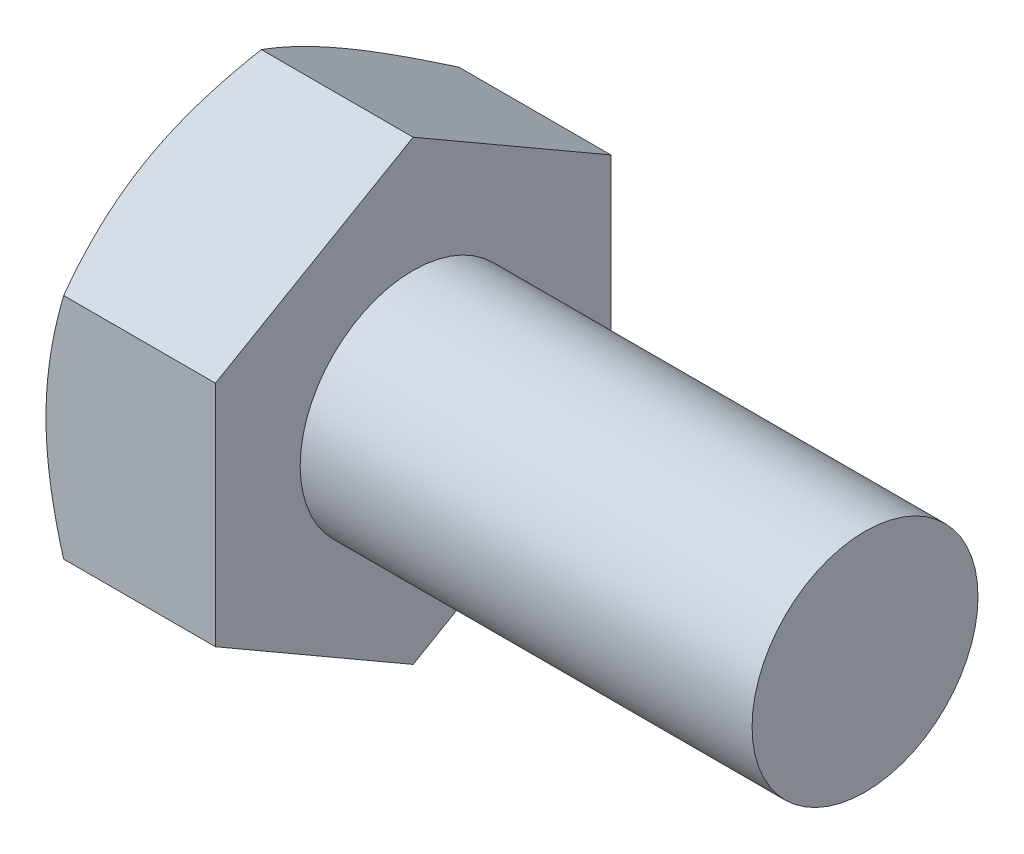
ISO-10303-21;
HEADER;
FILE_DESCRIPTION(('STEP AP214'),'2;1');
FILE_NAME('part.step','',(''),(''),'','','');
FILE_SCHEMA(('AUTOMOTIVE_DESIGN { 1 0 10303 214 1 1 1 1 }'));
ENDSEC;
DATA;
#1=APPLICATION_CONTEXT('core data for automotive mechanical design processes');
#2=APPLICATION_PROTOCOL_DEFINITION('international standard','automotive_design',2000,#1);
#3=PRODUCT_CONTEXT('',#1,'mechanical');
#4=PRODUCT('Part','Part','',(#3));
#5=PRODUCT_RELATED_PRODUCT_CATEGORY('part','',(#4));
#6=PRODUCT_DEFINITION_FORMATION('','',#4);
#7=PRODUCT_DEFINITION_CONTEXT('part definition',#1,'design');
#8=PRODUCT_DEFINITION('design','',#6,#7);
#9=PRODUCT_DEFINITION_SHAPE('','',#8);
#10=(LENGTH_UNIT() NAMED_UNIT(*) SI_UNIT(.MILLI.,.METRE.));
#11=(NAMED_UNIT(*) PLANE_ANGLE_UNIT() SI_UNIT($,.RADIAN.));
#12=(NAMED_UNIT(*) SI_UNIT($,.STERADIAN.) SOLID_ANGLE_UNIT());
#13=UNCERTAINTY_MEASURE_WITH_UNIT(LENGTH_MEASURE(1.E-05),#10,'distance_accuracy_value','');
#14=(GEOMETRIC_REPRESENTATION_CONTEXT(3) GLOBAL_UNCERTAINTY_ASSIGNED_CONTEXT((#13)) GLOBAL_UNIT_ASSIGNED_CONTEXT((#10,
#11,#12)) REPRESENTATION_CONTEXT('',''));
#15=CARTESIAN_POINT('',(0.,0.,0.));
#16=DIRECTION('',(0.,0.,1.));
#17=DIRECTION('',(1.,0.,0.));
#18=AXIS2_PLACEMENT_3D('',#15,#16,#17);
#19=CARTESIAN_POINT('',(3.,2.,0.));
#20=DIRECTION('',(-1.,0.,0.));
#21=DIRECTION('',(0.,0.,1.));
#22=AXIS2_PLACEMENT_3D('',#19,#20,#21);
#23=PLANE('',#22);
#24=CARTESIAN_POINT('',(3.,0.,0.));
#25=DIRECTION('',(-1.,0.,0.));
#26=DIRECTION('',(0.,0.,1.));
#27=AXIS2_PLACEMENT_3D('',#24,#25,#26);
#28=CIRCLE('',#27,2.);
#29=CARTESIAN_POINT('',(3.,0.,2.));
#30=VERTEX_POINT('',#29);
#31=EDGE_CURVE('E191',#30,#30,#28,.T.);
#32=ORIENTED_EDGE('',*,*,#31,.T.);
#33=EDGE_LOOP('',(#32));
#34=FACE_BOUND('',#33,.T.);
#35=DIRECTION('',(0.,1.,0.));
#36=VECTOR('',#35,1.);
#37=CARTESIAN_POINT('',(3.,-2.02072595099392,3.5));
#38=LINE('',#37,#36);
#39=CARTESIAN_POINT('',(3.,-2.02072595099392,3.5));
#40=VERTEX_POINT('',#39);
#41=CARTESIAN_POINT('',(3.,2.02072595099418,3.5));
#42=VERTEX_POINT('',#41);
#43=EDGE_CURVE('E55',#40,#42,#38,.T.);
#44=ORIENTED_EDGE('',*,*,#43,.F.);
#45=DIRECTION('',(0.,0.50000000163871,0.866025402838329));
#46=VECTOR('',#45,1.);
#47=CARTESIAN_POINT('',(3.,-4.04145190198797,0.));
#48=LINE('',#47,#46);
#49=CARTESIAN_POINT('',(3.,-4.04145190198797,0.));
#50=VERTEX_POINT('',#49);
#51=EDGE_CURVE('E128',#50,#40,#48,.T.);
#52=ORIENTED_EDGE('',*,*,#51,.F.);
#53=DIRECTION('',(0.,-0.50000000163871,0.866025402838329));
#54=VECTOR('',#53,1.);
#55=CARTESIAN_POINT('',(3.,-2.02072595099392,-3.5));
#56=LINE('',#55,#54);
#57=CARTESIAN_POINT('',(3.,-2.02072595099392,-3.5));
#58=VERTEX_POINT('',#57);
#59=EDGE_CURVE('E126',#58,#50,#56,.T.);
#60=ORIENTED_EDGE('',*,*,#59,.F.);
#61=DIRECTION('',(0.,-1.,0.));
#62=VECTOR('',#61,1.);
#63=CARTESIAN_POINT('',(3.,2.02072595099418,-3.5));
#64=LINE('',#63,#62);
#65=CARTESIAN_POINT('',(3.,2.02072595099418,-3.5));
#66=VERTEX_POINT('',#65);
#67=EDGE_CURVE('E109',#66,#58,#64,.T.);
#68=ORIENTED_EDGE('',*,*,#67,.F.);
#69=DIRECTION('',(0.,-0.50000000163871,-0.866025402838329));
#70=VECTOR('',#69,1.);
#71=CARTESIAN_POINT('',(3.,4.04145190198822,0.));
#72=LINE('',#71,#70);
#73=CARTESIAN_POINT('',(3.,4.04145190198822,0.));
#74=VERTEX_POINT('',#73);
#75=EDGE_CURVE('E118',#74,#66,#72,.T.);
#76=ORIENTED_EDGE('',*,*,#75,.F.);
#77=DIRECTION('',(0.,0.50000000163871,-0.866025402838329));
#78=VECTOR('',#77,1.);
#79=CARTESIAN_POINT('',(3.,2.02072595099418,3.5));
#80=LINE('',#79,#78);
#81=EDGE_CURVE('E122',#42,#74,#80,.T.);
#82=ORIENTED_EDGE('',*,*,#81,.F.);
#83=EDGE_LOOP('',(#44,#52,#60,#68,#76,#82));
#84=FACE_BOUND('',#83,.T.);
#85=ADVANCED_FACE('F32',(#34,#84),#23,.F.);
#86=CARTESIAN_POINT('',(-25.4,0.,0.));
#87=DIRECTION('',(-1.,0.,0.));
#88=DIRECTION('',(0.,0.,1.));
#89=AXIS2_PLACEMENT_3D('',#86,#87,#88);
#90=CYLINDRICAL_SURFACE('',#89,2.);
#91=CARTESIAN_POINT('',(11.,0.,0.));
#92=DIRECTION('',(-1.,0.,0.));
#93=DIRECTION('',(0.,0.,1.));
#94=AXIS2_PLACEMENT_3D('',#91,#92,#93);
#95=CIRCLE('',#94,2.);
#96=CARTESIAN_POINT('',(11.,0.,2.));
#97=VERTEX_POINT('',#96);
#98=EDGE_CURVE('E11',#97,#97,#95,.T.);
#99=ORIENTED_EDGE('',*,*,#98,.T.);
#100=EDGE_LOOP('',(#99));
#101=FACE_BOUND('',#100,.T.);
#102=ORIENTED_EDGE('',*,*,#31,.F.);
#103=EDGE_LOOP('',(#102));
#104=FACE_BOUND('',#103,.T.);
#105=ADVANCED_FACE('F34',(#101,#104),#90,.T.);
#106=CARTESIAN_POINT('',(11.,2.,0.));
#107=DIRECTION('',(1.,0.,0.));
#108=DIRECTION('',(0.,0.,-1.));
#109=AXIS2_PLACEMENT_3D('',#106,#107,#108);
#110=PLANE('',#109);
#111=ORIENTED_EDGE('',*,*,#98,.F.);
#112=EDGE_LOOP('',(#111));
#113=FACE_BOUND('',#112,.T.);
#114=ADVANCED_FACE('F174',(#113),#110,.T.);
#115=CARTESIAN_POINT('',(3.,-2.02072595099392,3.5));
#116=DIRECTION('',(0.,0.,1.));
#117=DIRECTION('',(0.,-1.,0.));
#118=AXIS2_PLACEMENT_3D('',#115,#116,#117);
#119=PLANE('',#118);
#120=DIRECTION('',(-1.,0.,0.));
#121=VECTOR('',#120,1.);
#122=CARTESIAN_POINT('',(3.,-2.02072595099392,3.5));
#123=LINE('',#122,#121);
#124=CARTESIAN_POINT('',(0.312607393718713,-2.02072595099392,3.5));
#125=VERTEX_POINT('',#124);
#126=EDGE_CURVE('E135',#40,#125,#123,.T.);
#127=ORIENTED_EDGE('',*,*,#126,.F.);
#128=ORIENTED_EDGE('',*,*,#43,.T.);
#129=DIRECTION('',(-1.,0.,0.));
#130=VECTOR('',#129,1.);
#131=CARTESIAN_POINT('',(3.,2.02072595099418,3.5));
#132=LINE('',#131,#130);
#133=CARTESIAN_POINT('',(0.312607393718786,2.02072595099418,3.5));
#134=VERTEX_POINT('',#133);
#135=EDGE_CURVE('E134',#42,#134,#132,.T.);
#136=ORIENTED_EDGE('',*,*,#135,.T.);
#137=CARTESIAN_POINT('',(1.67484806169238,-5.35927249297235,3.5));
#138=CARTESIAN_POINT('',(1.60058625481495,-5.20560262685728,3.5));
#139=CARTESIAN_POINT('',(1.52706266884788,-5.05156943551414,3.5));
#140=CARTESIAN_POINT('',(1.38191378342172,-4.7425799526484,3.5));
#141=CARTESIAN_POINT('',(1.31028881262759,-4.58762350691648,3.5));
#142=CARTESIAN_POINT('',(1.1689816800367,-4.27575400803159,3.5));
#143=CARTESIAN_POINT('',(1.09931298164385,-4.11883483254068,3.5));
#144=CARTESIAN_POINT('',(0.962968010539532,-3.80370674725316,3.5));
#145=CARTESIAN_POINT('',(0.896291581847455,-3.64549790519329,3.5));
#146=CARTESIAN_POINT('',(0.765935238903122,-3.32557477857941,3.5));
#147=CARTESIAN_POINT('',(0.702302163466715,-3.16384130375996,3.5));
#148=CARTESIAN_POINT('',(0.580019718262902,-2.83846669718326,3.5));
#149=CARTESIAN_POINT('',(0.521370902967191,-2.67482535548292,3.5));
#150=CARTESIAN_POINT('',(0.410632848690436,-2.34571076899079,3.5));
#151=CARTESIAN_POINT('',(0.358529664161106,-2.18024226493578,3.5));
#152=CARTESIAN_POINT('',(0.262575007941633,-1.84695290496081,3.5));
#153=CARTESIAN_POINT('',(0.218720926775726,-1.67913281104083,3.5));
#154=CARTESIAN_POINT('',(0.141393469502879,-1.34102565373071,3.5));
#155=CARTESIAN_POINT('',(0.107922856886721,-1.17073794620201,3.5));
#156=CARTESIAN_POINT('',(0.053615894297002,-0.82810943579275,3.5));
#157=CARTESIAN_POINT('',(0.0327795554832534,-0.655768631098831,3.5));
#158=CARTESIAN_POINT('',(0.00558442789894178,-0.311027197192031,3.5));
#159=CARTESIAN_POINT('',(-0.00086601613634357,-0.138633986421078,3.5));
#160=CARTESIAN_POINT('',(0.00105333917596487,0.206031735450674,3.5));
#161=CARTESIAN_POINT('',(0.0094192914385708,0.378304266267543,3.5));
#162=CARTESIAN_POINT('',(0.0357682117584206,0.672484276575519,3.5));
#163=CARTESIAN_POINT('',(0.0503198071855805,0.794716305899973,3.5));
#164=CARTESIAN_POINT('',(0.0859356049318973,1.03823616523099,3.5));
#165=CARTESIAN_POINT('',(0.107000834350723,1.15952384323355,3.5));
#166=CARTESIAN_POINT('',(0.178861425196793,1.52187147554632,3.5));
#167=CARTESIAN_POINT('',(0.238303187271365,1.76123299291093,3.5));
#168=CARTESIAN_POINT('',(0.340824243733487,2.11940111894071,3.5));
#169=CARTESIAN_POINT('',(0.377746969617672,2.24007467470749,3.5));
#170=CARTESIAN_POINT('',(0.45524596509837,2.4801622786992,3.5));
#171=CARTESIAN_POINT('',(0.495819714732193,2.59957713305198,3.5));
#172=CARTESIAN_POINT('',(0.579776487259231,2.83664797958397,3.5));
#173=CARTESIAN_POINT('',(0.623142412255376,2.9543100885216,3.5));
#174=CARTESIAN_POINT('',(0.712419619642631,3.1887214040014,3.5));
#175=CARTESIAN_POINT('',(0.758331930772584,3.30547021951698,3.5));
#176=CARTESIAN_POINT('',(0.805266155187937,3.42179689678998,3.5));
#177=B_SPLINE_CURVE_WITH_KNOTS('',3,(#137,#138,#139,#140,#141,#142,#143,#144,#145,#146,#147,
#148,#149,#150,#151,#152,#153,#154,#155,#156,#157,#158,#159,#160,#161,#162,#163,#164,#165,#166,
#167,#168,#169,#170,#171,#172,#173,#174,#175,#176),.UNSPECIFIED.,.F.,.F.,(4,2,2,2,2,2,2,2,2,2,2,
2,2,2,2,2,2,2,2,4),(0.,0.512025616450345,1.02413929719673,1.53918358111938,2.05420098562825,
2.57554135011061,3.09693963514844,3.617207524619,4.13731055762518,4.65755189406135,
5.17779369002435,5.69471134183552,6.2114947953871,6.58060002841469,6.9497634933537,
7.68863984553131,8.06719737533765,8.44549559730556,8.82166450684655,9.19798651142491),.UNSPECIFIED.);
#178=CARTESIAN_POINT('',(0.,0.,3.5));
#179=VERTEX_POINT('',#178);
#180=EDGE_CURVE('E176',#179,#134,#177,.T.);
#181=ORIENTED_EDGE('',*,*,#180,.F.);
#182=EDGE_CURVE('E183',#125,#179,#177,.T.);
#183=ORIENTED_EDGE('',*,*,#182,.F.);
#184=EDGE_LOOP('',(#127,#128,#136,#181,#183));
#185=FACE_BOUND('',#184,.T.);
#186=ADVANCED_FACE('F170',(#185),#119,.T.);
#187=CARTESIAN_POINT('',(3.,-4.04145190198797,0.));
#188=DIRECTION('',(0.,-0.866025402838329,0.50000000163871));
#189=DIRECTION('',(0.,-0.50000000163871,-0.866025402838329));
#190=AXIS2_PLACEMENT_3D('',#187,#188,#189);
#191=PLANE('',#190);
#192=DIRECTION('',(-1.,0.,0.));
#193=VECTOR('',#192,1.);
#194=CARTESIAN_POINT('',(3.,-4.04145190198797,0.));
#195=LINE('',#194,#193);
#196=CARTESIAN_POINT('',(0.312607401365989,-4.04145190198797,0.));
#197=VERTEX_POINT('',#196);
#198=EDGE_CURVE('E139',#50,#197,#195,.T.);
#199=ORIENTED_EDGE('',*,*,#198,.F.);
#200=ORIENTED_EDGE('',*,*,#51,.T.);
#201=ORIENTED_EDGE('',*,*,#126,.T.);
#202=CARTESIAN_POINT('',(0.312674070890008,-4.04156737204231,-0.000200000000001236));
#203=CARTESIAN_POINT('',(0.261385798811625,-3.95276675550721,0.153607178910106));
#204=CARTESIAN_POINT('',(0.214740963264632,-3.86319961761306,0.308742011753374));
#205=CARTESIAN_POINT('',(0.133321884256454,-3.6825143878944,0.621698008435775));
#206=CARTESIAN_POINT('',(0.098576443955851,-3.59139308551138,0.779524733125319));
#207=CARTESIAN_POINT('',(0.0444900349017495,-3.41027975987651,1.09322221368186));
#208=CARTESIAN_POINT('',(0.0247890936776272,-3.32031560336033,1.24904470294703));
#209=CARTESIAN_POINT('',(0.00127013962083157,-3.13996397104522,1.56142289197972));
#210=CARTESIAN_POINT('',(-0.00256734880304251,-3.04957715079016,1.71797745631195));
#211=CARTESIAN_POINT('',(0.00541530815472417,-2.88068385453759,2.01050922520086));
#212=CARTESIAN_POINT('',(0.0152754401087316,-2.80215209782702,2.14653021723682));
#213=CARTESIAN_POINT('',(0.0465264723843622,-2.64560021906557,2.41768602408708));
#214=CARTESIAN_POINT('',(0.0679280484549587,-2.56758063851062,2.55281990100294));
#215=CARTESIAN_POINT('',(0.121430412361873,-2.41070597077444,2.82453479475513));
#216=CARTESIAN_POINT('',(0.153757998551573,-2.33187073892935,2.96108142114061));
#217=CARTESIAN_POINT('',(0.227128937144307,-2.1753760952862,3.23213809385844));
#218=CARTESIAN_POINT('',(0.268155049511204,-2.09771467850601,3.3666516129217));
#219=CARTESIAN_POINT('',(0.312674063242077,-2.02061048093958,3.5002));
#220=B_SPLINE_CURVE_WITH_KNOTS('',3,(#202,#203,#204,#205,#206,#207,#208,#209,#210,#211,#212,
#213,#214,#215,#216,#217,#218,#219),.UNSPECIFIED.,.F.,.F.,(4,2,2,2,2,2,2,2,4),(0.,
0.554793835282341,1.11092124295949,1.65328467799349,2.19498205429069,2.66665131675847,
3.13875761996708,3.62133613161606,4.10296699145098),.UNSPECIFIED.);
#221=CARTESIAN_POINT('',(0.,-3.03108891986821,1.75000001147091));
#222=VERTEX_POINT('',#221);
#223=EDGE_CURVE('E185',#222,#125,#220,.T.);
#224=ORIENTED_EDGE('',*,*,#223,.F.);
#225=EDGE_CURVE('E184',#197,#222,#220,.T.);
#226=ORIENTED_EDGE('',*,*,#225,.F.);
#227=EDGE_LOOP('',(#199,#200,#201,#224,#226));
#228=FACE_BOUND('',#227,.T.);
#229=ADVANCED_FACE('F173',(#228),#191,.T.);
#230=CARTESIAN_POINT('',(3.,-2.02072595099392,-3.5));
#231=DIRECTION('',(0.,-0.866025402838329,-0.50000000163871));
#232=DIRECTION('',(0.,0.50000000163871,-0.866025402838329));
#233=AXIS2_PLACEMENT_3D('',#230,#231,#232);
#234=PLANE('',#233);
#235=DIRECTION('',(-1.,0.,0.));
#236=VECTOR('',#235,1.);
#237=CARTESIAN_POINT('',(3.,-2.02072595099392,-3.5));
#238=LINE('',#237,#236);
#239=CARTESIAN_POINT('',(0.312607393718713,-2.02072595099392,-3.5));
#240=VERTEX_POINT('',#239);
#241=EDGE_CURVE('E115',#58,#240,#238,.T.);
#242=ORIENTED_EDGE('',*,*,#241,.F.);
#243=ORIENTED_EDGE('',*,*,#59,.T.);
#244=ORIENTED_EDGE('',*,*,#198,.T.);
#245=CARTESIAN_POINT('',(0.312674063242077,-2.02061048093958,-3.5002));
#246=CARTESIAN_POINT('',(0.261385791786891,-2.10941109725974,-3.34639282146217));
#247=CARTESIAN_POINT('',(0.214740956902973,-2.19897823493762,-3.19125798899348));
#248=CARTESIAN_POINT('',(0.133321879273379,-2.37966346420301,-2.87830199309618));
#249=CARTESIAN_POINT('',(0.0985764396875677,-2.47078476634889,-2.72047526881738));
#250=CARTESIAN_POINT('',(0.0444900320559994,-2.65189809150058,-2.40677778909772));
#251=CARTESIAN_POINT('',(0.0247890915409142,-2.74186224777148,-2.25095530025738));
#252=CARTESIAN_POINT('',(0.00127013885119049,-2.92221387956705,-1.93857711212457));
#253=CARTESIAN_POINT('',(-0.00256734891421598,-3.01260069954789,-1.78202254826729));
#254=CARTESIAN_POINT('',(0.0054153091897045,-3.18149399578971,-1.48949077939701));
#255=CARTESIAN_POINT('',(0.0152754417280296,-3.26002575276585,-1.35346978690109));
#256=CARTESIAN_POINT('',(0.0465264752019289,-3.41657763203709,-1.08231397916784));
#257=CARTESIAN_POINT('',(0.0679280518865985,-3.49459721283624,-0.947180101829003));
#258=CARTESIAN_POINT('',(0.121430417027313,-3.65147188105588,-0.675465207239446));
#259=CARTESIAN_POINT('',(0.153758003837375,-3.73030711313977,-0.538918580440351));
#260=CARTESIAN_POINT('',(0.227128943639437,-3.88680175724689,-0.267861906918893));
#261=CARTESIAN_POINT('',(0.268155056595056,-3.96446317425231,-0.133348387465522));
#262=CARTESIAN_POINT('',(0.312674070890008,-4.04156737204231,0.000199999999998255));
#263=B_SPLINE_CURVE_WITH_KNOTS('',3,(#245,#246,#247,#248,#249,#250,#251,#252,#253,#254,#255,
#256,#257,#258,#259,#260,#261,#262),.UNSPECIFIED.,.F.,.F.,(4,2,2,2,2,2,2,2,4),(0.,
0.554793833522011,1.11092123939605,1.6532846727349,2.19498204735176,2.66665131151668,
3.1387576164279,3.6213361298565,4.10296699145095),.UNSPECIFIED.);
#264=CARTESIAN_POINT('',(0.,-3.03108891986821,-1.75000001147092));
#265=VERTEX_POINT('',#264);
#266=EDGE_CURVE('E214',#265,#197,#263,.T.);
#267=ORIENTED_EDGE('',*,*,#266,.F.);
#268=EDGE_CURVE('E219',#240,#265,#263,.T.);
#269=ORIENTED_EDGE('',*,*,#268,.F.);
#270=EDGE_LOOP('',(#242,#243,#244,#267,#269));
#271=FACE_BOUND('',#270,.T.);
#272=ADVANCED_FACE('F246',(#271),#234,.T.);
#273=CARTESIAN_POINT('',(3.,2.02072595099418,-3.5));
#274=DIRECTION('',(0.,0.,-1.));
#275=DIRECTION('',(-1.,0.,0.));
#276=AXIS2_PLACEMENT_3D('',#273,#274,#275);
#277=PLANE('',#276);
#278=DIRECTION('',(-1.,0.,0.));
#279=VECTOR('',#278,1.);
#280=CARTESIAN_POINT('',(3.,2.02072595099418,-3.5));
#281=LINE('',#280,#279);
#282=CARTESIAN_POINT('',(0.312607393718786,2.02072595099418,-3.5));
#283=VERTEX_POINT('',#282);
#284=EDGE_CURVE('E104',#66,#283,#281,.T.);
#285=ORIENTED_EDGE('',*,*,#284,.F.);
#286=ORIENTED_EDGE('',*,*,#67,.T.);
#287=ORIENTED_EDGE('',*,*,#241,.T.);
#288=CARTESIAN_POINT('',(1.67484806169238,-5.35927249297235,-3.5));
#289=CARTESIAN_POINT('',(1.60058625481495,-5.20560262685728,-3.5));
#290=CARTESIAN_POINT('',(1.52706266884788,-5.05156943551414,-3.5));
#291=CARTESIAN_POINT('',(1.38191378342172,-4.7425799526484,-3.5));
#292=CARTESIAN_POINT('',(1.31028881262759,-4.58762350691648,-3.5));
#293=CARTESIAN_POINT('',(1.1689816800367,-4.27575400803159,-3.5));
#294=CARTESIAN_POINT('',(1.09931298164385,-4.11883483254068,-3.5));
#295=CARTESIAN_POINT('',(0.962968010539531,-3.80370674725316,-3.5));
#296=CARTESIAN_POINT('',(0.896291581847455,-3.64549790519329,-3.5));
#297=CARTESIAN_POINT('',(0.765935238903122,-3.32557477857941,-3.5));
#298=CARTESIAN_POINT('',(0.702302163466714,-3.16384130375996,-3.5));
#299=CARTESIAN_POINT('',(0.580019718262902,-2.83846669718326,-3.5));
#300=CARTESIAN_POINT('',(0.521370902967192,-2.67482535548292,-3.5));
#301=CARTESIAN_POINT('',(0.410632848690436,-2.34571076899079,-3.5));
#302=CARTESIAN_POINT('',(0.358529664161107,-2.18024226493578,-3.5));
#303=CARTESIAN_POINT('',(0.262575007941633,-1.84695290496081,-3.5));
#304=CARTESIAN_POINT('',(0.218720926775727,-1.67913281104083,-3.5));
#305=CARTESIAN_POINT('',(0.141393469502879,-1.34102565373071,-3.5));
#306=CARTESIAN_POINT('',(0.107922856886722,-1.17073794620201,-3.5));
#307=CARTESIAN_POINT('',(0.0536158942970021,-0.828109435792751,-3.5));
#308=CARTESIAN_POINT('',(0.0327795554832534,-0.655768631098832,-3.5));
#309=CARTESIAN_POINT('',(0.00558442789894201,-0.311027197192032,-3.5));
#310=CARTESIAN_POINT('',(-0.000866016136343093,-0.138633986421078,-3.5));
#311=CARTESIAN_POINT('',(0.00105333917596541,0.206031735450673,-3.5));
#312=CARTESIAN_POINT('',(0.00941929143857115,0.378304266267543,-3.5));
#313=CARTESIAN_POINT('',(0.035768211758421,0.672484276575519,-3.5));
#314=CARTESIAN_POINT('',(0.0503198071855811,0.794716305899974,-3.5));
#315=CARTESIAN_POINT('',(0.0859356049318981,1.03823616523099,-3.5));
#316=CARTESIAN_POINT('',(0.107000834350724,1.15952384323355,-3.5));
#317=CARTESIAN_POINT('',(0.178861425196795,1.52187147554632,-3.5));
#318=CARTESIAN_POINT('',(0.238303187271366,1.76123299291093,-3.5));
#319=CARTESIAN_POINT('',(0.340824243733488,2.11940111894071,-3.5));
#320=CARTESIAN_POINT('',(0.377746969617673,2.24007467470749,-3.5));
#321=CARTESIAN_POINT('',(0.455245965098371,2.4801622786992,-3.5));
#322=CARTESIAN_POINT('',(0.495819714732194,2.59957713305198,-3.5));
#323=CARTESIAN_POINT('',(0.579776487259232,2.83664797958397,-3.5));
#324=CARTESIAN_POINT('',(0.623142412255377,2.95431008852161,-3.5));
#325=CARTESIAN_POINT('',(0.712419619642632,3.1887214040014,-3.5));
#326=CARTESIAN_POINT('',(0.758331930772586,3.30547021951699,-3.5));
#327=CARTESIAN_POINT('',(0.80526615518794,3.42179689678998,-3.5));
#328=B_SPLINE_CURVE_WITH_KNOTS('',3,(#288,#289,#290,#291,#292,#293,#294,#295,#296,#297,#298,
#299,#300,#301,#302,#303,#304,#305,#306,#307,#308,#309,#310,#311,#312,#313,#314,#315,#316,#317,
#318,#319,#320,#321,#322,#323,#324,#325,#326,#327),.UNSPECIFIED.,.F.,.F.,(4,2,2,2,2,2,2,2,2,2,2,
2,2,2,2,2,2,2,2,4),(0.,0.512025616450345,1.02413929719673,1.53918358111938,2.05420098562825,
2.57554135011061,3.09693963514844,3.617207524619,4.13731055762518,4.65755189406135,
5.17779369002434,5.69471134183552,6.21149479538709,6.58060002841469,6.9497634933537,
7.68863984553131,8.06719737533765,8.44549559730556,8.82166450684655,9.19798651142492),.UNSPECIFIED.);
#329=CARTESIAN_POINT('',(0.,0.,-3.5));
#330=VERTEX_POINT('',#329);
#331=EDGE_CURVE('E215',#330,#240,#328,.F.);
#332=ORIENTED_EDGE('',*,*,#331,.F.);
#333=EDGE_CURVE('E112',#283,#330,#328,.F.);
#334=ORIENTED_EDGE('',*,*,#333,.F.);
#335=EDGE_LOOP('',(#285,#286,#287,#332,#334));
#336=FACE_BOUND('',#335,.T.);
#337=ADVANCED_FACE('F106',(#336),#277,.T.);
#338=CARTESIAN_POINT('',(3.,4.04145190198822,0.));
#339=DIRECTION('',(0.,0.866025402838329,-0.50000000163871));
#340=DIRECTION('',(0.,0.50000000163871,0.866025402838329));
#341=AXIS2_PLACEMENT_3D('',#338,#339,#340);
#342=PLANE('',#341);
#343=DIRECTION('',(-1.,0.,0.));
#344=VECTOR('',#343,1.);
#345=CARTESIAN_POINT('',(3.,4.04145190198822,0.));
#346=LINE('',#345,#344);
#347=CARTESIAN_POINT('',(0.312607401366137,4.04145190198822,0.));
#348=VERTEX_POINT('',#347);
#349=EDGE_CURVE('E47',#74,#348,#346,.T.);
#350=ORIENTED_EDGE('',*,*,#349,.F.);
#351=ORIENTED_EDGE('',*,*,#75,.T.);
#352=ORIENTED_EDGE('',*,*,#284,.T.);
#353=CARTESIAN_POINT('',(0.312674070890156,4.04156737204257,0.000199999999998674));
#354=CARTESIAN_POINT('',(0.26138579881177,3.95276675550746,-0.153607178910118));
#355=CARTESIAN_POINT('',(0.214740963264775,3.86319961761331,-0.308742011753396));
#356=CARTESIAN_POINT('',(0.133321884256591,3.68251438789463,-0.621698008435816));
#357=CARTESIAN_POINT('',(0.0985764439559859,3.59139308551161,-0.77952473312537));
#358=CARTESIAN_POINT('',(0.044490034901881,3.41027975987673,-1.09322221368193));
#359=CARTESIAN_POINT('',(0.0247890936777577,3.32031560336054,-1.24904470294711));
#360=CARTESIAN_POINT('',(0.00127013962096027,3.13996397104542,-1.56142289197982));
#361=CARTESIAN_POINT('',(-0.0025673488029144,3.04957715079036,-1.71797745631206));
#362=CARTESIAN_POINT('',(0.00541530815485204,2.88068385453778,-2.01050922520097));
#363=CARTESIAN_POINT('',(0.0152754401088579,2.80215209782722,-2.14653021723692));
#364=CARTESIAN_POINT('',(0.0465264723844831,2.64560021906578,-2.41768602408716));
#365=CARTESIAN_POINT('',(0.0679280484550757,2.56758063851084,-2.55281990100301));
#366=CARTESIAN_POINT('',(0.12143041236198,2.41070597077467,-2.82453479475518));
#367=CARTESIAN_POINT('',(0.153757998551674,2.33187073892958,-2.96108142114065));
#368=CARTESIAN_POINT('',(0.227128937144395,2.17537609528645,-3.23213809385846));
#369=CARTESIAN_POINT('',(0.268155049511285,2.09771467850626,-3.36665161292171));
#370=CARTESIAN_POINT('',(0.31267406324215,2.02061048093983,-3.5002));
#371=B_SPLINE_CURVE_WITH_KNOTS('',3,(#353,#354,#355,#356,#357,#358,#359,#360,#361,#362,#363,
#364,#365,#366,#367,#368,#369,#370),.UNSPECIFIED.,.F.,.F.,(4,2,2,2,2,2,2,2,4),(0.,
0.554793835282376,1.11092124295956,1.65328467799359,2.19498205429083,2.66665131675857,
3.13875761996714,3.62133613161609,4.10296699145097),.UNSPECIFIED.);
#372=CARTESIAN_POINT('',(0.,3.0310889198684,-1.75000001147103));
#373=VERTEX_POINT('',#372);
#374=EDGE_CURVE('E153',#373,#283,#371,.T.);
#375=ORIENTED_EDGE('',*,*,#374,.F.);
#376=EDGE_CURVE('E236',#348,#373,#371,.T.);
#377=ORIENTED_EDGE('',*,*,#376,.F.);
#378=EDGE_LOOP('',(#350,#351,#352,#375,#377));
#379=FACE_BOUND('',#378,.T.);
#380=ADVANCED_FACE('F119',(#379),#342,.T.);
#381=CARTESIAN_POINT('',(3.,2.02072595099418,3.5));
#382=DIRECTION('',(0.,0.866025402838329,0.50000000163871));
#383=DIRECTION('',(0.,-0.50000000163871,0.866025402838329));
#384=AXIS2_PLACEMENT_3D('',#381,#382,#383);
#385=PLANE('',#384);
#386=ORIENTED_EDGE('',*,*,#135,.F.);
#387=ORIENTED_EDGE('',*,*,#81,.T.);
#388=ORIENTED_EDGE('',*,*,#349,.T.);
#389=CARTESIAN_POINT('',(0.31267406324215,2.02061048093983,3.5002));
#390=CARTESIAN_POINT('',(0.261385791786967,2.10941109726,3.34639282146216));
#391=CARTESIAN_POINT('',(0.214740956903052,2.19897823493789,3.19125798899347));
#392=CARTESIAN_POINT('',(0.133321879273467,2.37966346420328,2.87830199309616));
#393=CARTESIAN_POINT('',(0.0985764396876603,2.47078476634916,2.72047526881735));
#394=CARTESIAN_POINT('',(0.0444900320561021,2.65189809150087,2.40677778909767));
#395=CARTESIAN_POINT('',(0.0247890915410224,2.74186224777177,2.25095530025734));
#396=CARTESIAN_POINT('',(0.00127013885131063,2.92221387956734,1.93857711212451));
#397=CARTESIAN_POINT('',(-0.00256734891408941,3.01260069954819,1.78202254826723));
#398=CARTESIAN_POINT('',(0.00541530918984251,3.18149399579,1.48949077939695));
#399=CARTESIAN_POINT('',(0.0152754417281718,3.26002575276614,1.35346978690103));
#400=CARTESIAN_POINT('',(0.0465264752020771,3.41657763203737,1.08231397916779));
#401=CARTESIAN_POINT('',(0.0679280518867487,3.49459721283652,0.947180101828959));
#402=CARTESIAN_POINT('',(0.121430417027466,3.65147188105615,0.675465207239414));
#403=CARTESIAN_POINT('',(0.153758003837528,3.73030711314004,0.538918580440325));
#404=CARTESIAN_POINT('',(0.227128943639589,3.88680175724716,0.267861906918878));
#405=CARTESIAN_POINT('',(0.268155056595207,3.96446317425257,0.133348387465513));
#406=CARTESIAN_POINT('',(0.312674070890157,4.04156737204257,-0.000200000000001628));
#407=B_SPLINE_CURVE_WITH_KNOTS('',3,(#389,#390,#391,#392,#393,#394,#395,#396,#397,#398,#399,
#400,#401,#402,#403,#404,#405,#406),.UNSPECIFIED.,.F.,.F.,(4,2,2,2,2,2,2,2,4),(0.,
0.55479383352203,1.11092123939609,1.65328467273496,2.19498204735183,2.66665131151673,
3.13875761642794,3.62133612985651,4.10296699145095),.UNSPECIFIED.);
#408=CARTESIAN_POINT('',(0.,3.0310889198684,1.75000001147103));
#409=VERTEX_POINT('',#408);
#410=EDGE_CURVE('E138',#409,#348,#407,.T.);
#411=ORIENTED_EDGE('',*,*,#410,.F.);
#412=EDGE_CURVE('E152',#134,#409,#407,.T.);
#413=ORIENTED_EDGE('',*,*,#412,.F.);
#414=EDGE_LOOP('',(#386,#387,#388,#411,#413));
#415=FACE_BOUND('',#414,.T.);
#416=ADVANCED_FACE('F163',(#415),#385,.T.);
#417=CARTESIAN_POINT('',(0.,0.,0.));
#418=DIRECTION('',(1.,0.,0.));
#419=DIRECTION('',(0.,0.,-1.));
#420=AXIS2_PLACEMENT_3D('',#417,#418,#419);
#421=CONICAL_SURFACE('',#420,3.5,1.0471975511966);
#422=CARTESIAN_POINT('',(0.,0.,0.));
#423=DIRECTION('',(-1.,0.,0.));
#424=DIRECTION('',(0.,0.,1.));
#425=AXIS2_PLACEMENT_3D('',#422,#423,#424);
#426=CIRCLE('',#425,3.5);
#427=EDGE_CURVE('E193',#222,#179,#426,.T.);
#428=ORIENTED_EDGE('',*,*,#427,.F.);
#429=ORIENTED_EDGE('',*,*,#223,.T.);
#430=ORIENTED_EDGE('',*,*,#182,.T.);
#431=EDGE_LOOP('',(#428,#429,#430));
#432=FACE_BOUND('',#431,.T.);
#433=ADVANCED_FACE('F167',(#432),#421,.T.);
#434=EDGE_CURVE('E201',#265,#222,#426,.T.);
#435=ORIENTED_EDGE('',*,*,#434,.F.);
#436=ORIENTED_EDGE('',*,*,#266,.T.);
#437=ORIENTED_EDGE('',*,*,#225,.T.);
#438=EDGE_LOOP('',(#435,#436,#437));
#439=FACE_BOUND('',#438,.T.);
#440=ADVANCED_FACE('F224',(#439),#421,.T.);
#441=ORIENTED_EDGE('',*,*,#331,.T.);
#442=ORIENTED_EDGE('',*,*,#268,.T.);
#443=EDGE_CURVE('E204',#330,#265,#426,.T.);
#444=ORIENTED_EDGE('',*,*,#443,.F.);
#445=EDGE_LOOP('',(#441,#442,#444));
#446=FACE_BOUND('',#445,.T.);
#447=ADVANCED_FACE('F159',(#446),#421,.T.);
#448=ORIENTED_EDGE('',*,*,#374,.T.);
#449=ORIENTED_EDGE('',*,*,#333,.T.);
#450=EDGE_CURVE('E200',#373,#330,#426,.T.);
#451=ORIENTED_EDGE('',*,*,#450,.F.);
#452=EDGE_LOOP('',(#448,#449,#451));
#453=FACE_BOUND('',#452,.T.);
#454=ADVANCED_FACE('F213',(#453),#421,.T.);
#455=EDGE_CURVE('E40',#179,#409,#426,.T.);
#456=ORIENTED_EDGE('',*,*,#455,.F.);
#457=ORIENTED_EDGE('',*,*,#180,.T.);
#458=ORIENTED_EDGE('',*,*,#412,.T.);
#459=EDGE_LOOP('',(#456,#457,#458));
#460=FACE_BOUND('',#459,.T.);
#461=ADVANCED_FACE('F232',(#460),#421,.T.);
#462=CARTESIAN_POINT('',(0.,0.,0.));
#463=DIRECTION('',(-1.,0.,0.));
#464=DIRECTION('',(0.,0.,1.));
#465=AXIS2_PLACEMENT_3D('',#462,#463,#464);
#466=PLANE('',#465);
#467=ORIENTED_EDGE('',*,*,#455,.T.);
#468=EDGE_CURVE('E195',#409,#373,#426,.T.);
#469=ORIENTED_EDGE('',*,*,#468,.T.);
#470=ORIENTED_EDGE('',*,*,#450,.T.);
#471=ORIENTED_EDGE('',*,*,#443,.T.);
#472=ORIENTED_EDGE('',*,*,#434,.T.);
#473=ORIENTED_EDGE('',*,*,#427,.T.);
#474=EDGE_LOOP('',(#467,#469,#470,#471,#472,#473));
#475=FACE_BOUND('',#474,.T.);
#476=ADVANCED_FACE('F210',(#475),#466,.T.);
#477=ORIENTED_EDGE('',*,*,#410,.T.);
#478=ORIENTED_EDGE('',*,*,#376,.T.);
#479=ORIENTED_EDGE('',*,*,#468,.F.);
#480=EDGE_LOOP('',(#477,#478,#479));
#481=FACE_BOUND('',#480,.T.);
#482=ADVANCED_FACE('F235',(#481),#421,.T.);
#483=CLOSED_SHELL('',(#85,#105,#114,#186,#229,#272,#337,#380,#416,#433,#440,#447,#454,#461,#476,#482));
#484=MANIFOLD_SOLID_BREP('B2',#483);
#485=ADVANCED_BREP_SHAPE_REPRESENTATION('',(#18,#484),#14);
#486=SHAPE_DEFINITION_REPRESENTATION(#9,#485);
ENDSEC;
END-ISO-10303-21;
